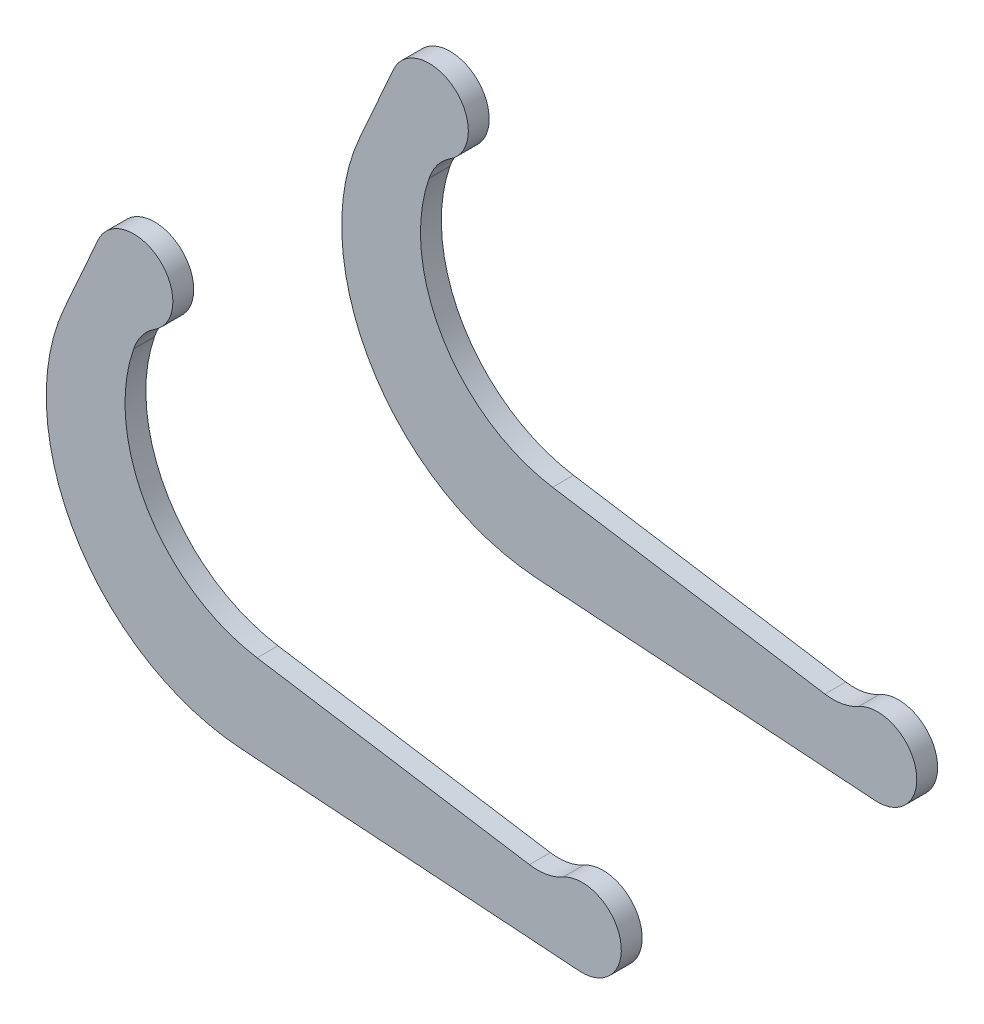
ISO-10303-21;
HEADER;
FILE_DESCRIPTION(('STEP AP214'),'2;1');
FILE_NAME('part.step','',(''),(''),'','','');
FILE_SCHEMA(('AUTOMOTIVE_DESIGN { 1 0 10303 214 1 1 1 1 }'));
ENDSEC;
DATA;
#1=APPLICATION_CONTEXT('core data for automotive mechanical design processes');
#2=APPLICATION_PROTOCOL_DEFINITION('international standard','automotive_design',2000,#1);
#3=PRODUCT_CONTEXT('',#1,'mechanical');
#4=PRODUCT('Part','Part','',(#3));
#5=PRODUCT_RELATED_PRODUCT_CATEGORY('part','',(#4));
#6=PRODUCT_DEFINITION_FORMATION('','',#4);
#7=PRODUCT_DEFINITION_CONTEXT('part definition',#1,'design');
#8=PRODUCT_DEFINITION('design','',#6,#7);
#9=PRODUCT_DEFINITION_SHAPE('','',#8);
#10=(LENGTH_UNIT() NAMED_UNIT(*) SI_UNIT(.MILLI.,.METRE.));
#11=(NAMED_UNIT(*) PLANE_ANGLE_UNIT() SI_UNIT($,.RADIAN.));
#12=(NAMED_UNIT(*) SI_UNIT($,.STERADIAN.) SOLID_ANGLE_UNIT());
#13=UNCERTAINTY_MEASURE_WITH_UNIT(LENGTH_MEASURE(1.E-05),#10,'distance_accuracy_value','');
#14=(GEOMETRIC_REPRESENTATION_CONTEXT(3) GLOBAL_UNCERTAINTY_ASSIGNED_CONTEXT((#13)) GLOBAL_UNIT_ASSIGNED_CONTEXT((#10,
#11,#12)) REPRESENTATION_CONTEXT('',''));
#15=CARTESIAN_POINT('',(0.,0.,0.));
#16=DIRECTION('',(0.,0.,1.));
#17=DIRECTION('',(1.,0.,0.));
#18=AXIS2_PLACEMENT_3D('',#15,#16,#17);
#19=CARTESIAN_POINT('',(58.5239082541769,438.182860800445,-60.6500000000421));
#20=DIRECTION('',(-0.913861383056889,0.406026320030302,0.));
#21=DIRECTION('',(-0.406026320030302,-0.913861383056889,0.));
#22=AXIS2_PLACEMENT_3D('',#19,#20,#21);
#23=PLANE('',#22);
#24=DIRECTION('',(-0.406026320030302,-0.913861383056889,8.37068520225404E-13));
#25=VECTOR('',#24,1.);
#26=CARTESIAN_POINT('',(58.5239082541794,438.182860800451,-52.6500000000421));
#27=LINE('',#26,#25);
#28=CARTESIAN_POINT('',(58.5239082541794,438.182860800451,-52.6500000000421));
#29=VERTEX_POINT('',#28);
#30=CARTESIAN_POINT('',(45.5760695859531,409.040588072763,-52.6500000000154));
#31=VERTEX_POINT('',#30);
#32=EDGE_CURVE('P0_E146',#29,#31,#27,.T.);
#33=ORIENTED_EDGE('',*,*,#32,.F.);
#34=DIRECTION('',(3.1245699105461E-13,7.77144949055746E-13,1.));
#35=VECTOR('',#34,1.);
#36=CARTESIAN_POINT('',(58.5239082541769,438.182860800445,-60.6500000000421));
#37=LINE('',#36,#35);
#38=CARTESIAN_POINT('',(58.5239082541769,438.182860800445,-60.6500000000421));
#39=VERTEX_POINT('',#38);
#40=EDGE_CURVE('P0_E67',#39,#29,#37,.T.);
#41=ORIENTED_EDGE('',*,*,#40,.F.);
#42=DIRECTION('',(-0.406026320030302,-0.913861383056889,8.37068520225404E-13));
#43=VECTOR('',#42,1.);
#44=CARTESIAN_POINT('',(58.5239082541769,438.182860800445,-60.6500000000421));
#45=LINE('',#44,#43);
#46=CARTESIAN_POINT('',(45.5760695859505,409.040588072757,-60.6500000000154));
#47=VERTEX_POINT('',#46);
#48=EDGE_CURVE('P0_E118',#39,#47,#45,.T.);
#49=ORIENTED_EDGE('',*,*,#48,.T.);
#50=DIRECTION('',(3.1245699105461E-13,7.77144949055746E-13,1.));
#51=VECTOR('',#50,1.);
#52=CARTESIAN_POINT('',(45.5760695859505,409.040588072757,-60.6500000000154));
#53=LINE('',#52,#51);
#54=EDGE_CURVE('P0_E11',#47,#31,#53,.T.);
#55=ORIENTED_EDGE('',*,*,#54,.T.);
#56=EDGE_LOOP('',(#33,#41,#49,#55));
#57=FACE_BOUND('',#56,.T.);
#58=ADVANCED_FACE('P0_F16',(#57),#23,.T.);
#59=CARTESIAN_POINT('',(118.684980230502,376.558482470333,-60.650000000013));
#60=DIRECTION('',(3.1245699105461E-13,7.77144949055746E-13,1.));
#61=DIRECTION('',(0.,-1.,7.77144949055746E-13));
#62=AXIS2_PLACEMENT_3D('',#59,#60,#61);
#63=CYLINDRICAL_SURFACE('',#62,80.);
#64=CARTESIAN_POINT('',(118.684980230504,376.558482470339,-52.650000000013));
#65=DIRECTION('',(3.1245699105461E-13,7.77144949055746E-13,1.));
#66=DIRECTION('',(0.,1.,-7.77144949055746E-13));
#67=AXIS2_PLACEMENT_3D('',#64,#65,#66);
#68=CIRCLE('',#67,80.);
#69=CARTESIAN_POINT('',(113.166505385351,296.749044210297,-52.6499999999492));
#70=VERTEX_POINT('',#69);
#71=EDGE_CURVE('P0_E149',#31,#70,#68,.T.);
#72=ORIENTED_EDGE('',*,*,#71,.F.);
#73=ORIENTED_EDGE('',*,*,#54,.F.);
#74=CARTESIAN_POINT('',(118.684980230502,376.558482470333,-60.650000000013));
#75=DIRECTION('',(3.1245699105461E-13,7.77144949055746E-13,1.));
#76=DIRECTION('',(0.,1.,-7.77144949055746E-13));
#77=AXIS2_PLACEMENT_3D('',#74,#75,#76);
#78=CIRCLE('',#77,80.);
#79=CARTESIAN_POINT('',(113.166505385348,296.749044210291,-60.6499999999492));
#80=VERTEX_POINT('',#79);
#81=EDGE_CURVE('P0_E120',#47,#80,#78,.T.);
#82=ORIENTED_EDGE('',*,*,#81,.T.);
#83=DIRECTION('',(3.1245699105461E-13,7.77144949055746E-13,1.));
#84=VECTOR('',#83,1.);
#85=CARTESIAN_POINT('',(113.166505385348,296.749044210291,-60.6499999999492));
#86=LINE('',#85,#84);
#87=EDGE_CURVE('P0_E20',#80,#70,#86,.T.);
#88=ORIENTED_EDGE('',*,*,#87,.T.);
#89=EDGE_LOOP('',(#72,#73,#82,#88));
#90=FACE_BOUND('',#89,.T.);
#91=ADVANCED_FACE('P0_F164',(#90),#63,.T.);
#92=CARTESIAN_POINT('',(63.1127342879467,300.210044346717,-60.6499999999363));
#93=DIRECTION('',(-0.0689809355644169,-0.997617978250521,7.96847348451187E-13));
#94=DIRECTION('',(0.997617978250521,-0.0689809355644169,0.));
#95=AXIS2_PLACEMENT_3D('',#92,#93,#94);
#96=PLANE('',#95);
#97=DIRECTION('',(0.997617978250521,-0.0689809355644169,-2.58104526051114E-13));
#98=VECTOR('',#97,1.);
#99=CARTESIAN_POINT('',(63.1127342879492,300.210044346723,-52.6499999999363));
#100=LINE('',#99,#98);
#101=CARTESIAN_POINT('',(243.150900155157,287.761189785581,-52.6499999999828));
#102=VERTEX_POINT('',#101);
#103=EDGE_CURVE('P0_E125',#70,#102,#100,.T.);
#104=ORIENTED_EDGE('',*,*,#103,.F.);
#105=ORIENTED_EDGE('',*,*,#87,.F.);
#106=DIRECTION('',(0.997617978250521,-0.0689809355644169,-2.58104526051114E-13));
#107=VECTOR('',#106,1.);
#108=CARTESIAN_POINT('',(63.1127342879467,300.210044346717,-60.6499999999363));
#109=LINE('',#108,#107);
#110=CARTESIAN_POINT('',(243.150900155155,287.761189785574,-60.6499999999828));
#111=VERTEX_POINT('',#110);
#112=EDGE_CURVE('P0_E151',#80,#111,#109,.T.);
#113=ORIENTED_EDGE('',*,*,#112,.T.);
#114=DIRECTION('',(3.1245699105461E-13,7.77144949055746E-13,1.));
#115=VECTOR('',#114,1.);
#116=CARTESIAN_POINT('',(243.150900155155,287.761189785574,-60.6499999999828));
#117=LINE('',#116,#115);
#118=EDGE_CURVE('P0_E162',#111,#102,#117,.T.);
#119=ORIENTED_EDGE('',*,*,#118,.T.);
#120=EDGE_LOOP('',(#104,#105,#113,#119));
#121=FACE_BOUND('',#120,.T.);
#122=ADVANCED_FACE('P0_F18',(#121),#96,.T.);
#123=CARTESIAN_POINT('',(244.185614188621,302.725459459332,-60.6499999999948));
#124=DIRECTION('',(3.1245699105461E-13,7.77144949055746E-13,1.));
#125=DIRECTION('',(0.,-1.,7.77144949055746E-13));
#126=AXIS2_PLACEMENT_3D('',#123,#124,#125);
#127=CYLINDRICAL_SURFACE('',#126,15.);
#128=CARTESIAN_POINT('',(244.185614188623,302.725459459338,-52.6499999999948));
#129=DIRECTION('',(3.1245699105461E-13,7.77144949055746E-13,1.));
#130=DIRECTION('',(0.,1.,-7.77144949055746E-13));
#131=AXIS2_PLACEMENT_3D('',#128,#129,#130);
#132=CIRCLE('',#131,15.);
#133=CARTESIAN_POINT('',(236.854524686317,315.811907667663,-52.6500000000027));
#134=VERTEX_POINT('',#133);
#135=EDGE_CURVE('P0_E128',#102,#134,#132,.T.);
#136=ORIENTED_EDGE('',*,*,#135,.F.);
#137=ORIENTED_EDGE('',*,*,#118,.F.);
#138=CARTESIAN_POINT('',(244.185614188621,302.725459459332,-60.6499999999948));
#139=DIRECTION('',(3.1245699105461E-13,7.77144949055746E-13,1.));
#140=DIRECTION('',(0.,1.,-7.77144949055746E-13));
#141=AXIS2_PLACEMENT_3D('',#138,#139,#140);
#142=CIRCLE('',#141,15.);
#143=CARTESIAN_POINT('',(236.854524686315,315.811907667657,-60.6500000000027));
#144=VERTEX_POINT('',#143);
#145=EDGE_CURVE('P0_E220',#111,#144,#142,.T.);
#146=ORIENTED_EDGE('',*,*,#145,.T.);
#147=DIRECTION('',(3.1245699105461E-13,7.77144949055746E-13,1.));
#148=VECTOR('',#147,1.);
#149=CARTESIAN_POINT('',(236.854524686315,315.811907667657,-60.6500000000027));
#150=LINE('',#149,#148);
#151=EDGE_CURVE('P0_E161',#144,#134,#150,.T.);
#152=ORIENTED_EDGE('',*,*,#151,.T.);
#153=EDGE_LOOP('',(#136,#137,#146,#152));
#154=FACE_BOUND('',#153,.T.);
#155=ADVANCED_FACE('P0_F195',(#154),#127,.T.);
#156=CARTESIAN_POINT('',(227.07973868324,333.260505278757,-60.6500000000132));
#157=DIRECTION('',(3.1245699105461E-13,7.77144949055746E-13,1.));
#158=DIRECTION('',(0.,-1.,7.77144949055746E-13));
#159=AXIS2_PLACEMENT_3D('',#156,#157,#158);
#160=CYLINDRICAL_SURFACE('',#159,20.);
#161=CARTESIAN_POINT('',(227.079738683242,333.260505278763,-52.6500000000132));
#162=DIRECTION('',(-3.1245699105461E-13,-7.77144949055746E-13,-1.));
#163=DIRECTION('',(0.,1.,-7.77144949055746E-13));
#164=AXIS2_PLACEMENT_3D('',#161,#162,#163);
#165=CIRCLE('',#164,20.);
#166=CARTESIAN_POINT('',(223.966407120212,313.504312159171,-52.6499999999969));
#167=VERTEX_POINT('',#166);
#168=EDGE_CURVE('P0_E131',#134,#167,#165,.T.);
#169=ORIENTED_EDGE('',*,*,#168,.F.);
#170=ORIENTED_EDGE('',*,*,#151,.F.);
#171=CARTESIAN_POINT('',(227.07973868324,333.260505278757,-60.6500000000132));
#172=DIRECTION('',(-3.1245699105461E-13,-7.77144949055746E-13,-1.));
#173=DIRECTION('',(0.,1.,-7.77144949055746E-13));
#174=AXIS2_PLACEMENT_3D('',#171,#172,#173);
#175=CIRCLE('',#174,20.);
#176=CARTESIAN_POINT('',(223.966407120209,313.504312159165,-60.6499999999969));
#177=VERTEX_POINT('',#176);
#178=EDGE_CURVE('P0_E207',#144,#177,#175,.T.);
#179=ORIENTED_EDGE('',*,*,#178,.T.);
#180=DIRECTION('',(3.1245699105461E-13,7.77144949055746E-13,1.));
#181=VECTOR('',#180,1.);
#182=CARTESIAN_POINT('',(223.966407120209,313.504312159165,-60.6499999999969));
#183=LINE('',#182,#181);
#184=EDGE_CURVE('P0_E159',#177,#167,#183,.T.);
#185=ORIENTED_EDGE('',*,*,#184,.T.);
#186=EDGE_LOOP('',(#169,#170,#179,#185));
#187=FACE_BOUND('',#186,.T.);
#188=ADVANCED_FACE('P0_F192',(#187),#160,.F.);
#189=CARTESIAN_POINT('',(232.521089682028,312.156200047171,-60.6499999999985));
#190=DIRECTION('',(0.155666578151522,0.987809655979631,-8.16310395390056E-13));
#191=DIRECTION('',(-0.987809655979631,0.155666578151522,0.));
#192=AXIS2_PLACEMENT_3D('',#189,#190,#191);
#193=PLANE('',#192);
#194=DIRECTION('',(-0.987809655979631,0.155666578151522,1.87672537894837E-13));
#195=VECTOR('',#194,1.);
#196=CARTESIAN_POINT('',(232.521089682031,312.156200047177,-52.6499999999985));
#197=LINE('',#196,#195);
#198=CARTESIAN_POINT('',(119.540383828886,329.960561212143,-52.649999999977));
#199=VERTEX_POINT('',#198);
#200=EDGE_CURVE('P0_E134',#167,#199,#197,.T.);
#201=ORIENTED_EDGE('',*,*,#200,.F.);
#202=ORIENTED_EDGE('',*,*,#184,.F.);
#203=DIRECTION('',(-0.987809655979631,0.155666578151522,1.87672537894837E-13));
#204=VECTOR('',#203,1.);
#205=CARTESIAN_POINT('',(232.521089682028,312.156200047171,-60.6499999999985));
#206=LINE('',#205,#204);
#207=CARTESIAN_POINT('',(119.540383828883,329.960561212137,-60.649999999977));
#208=VERTEX_POINT('',#207);
#209=EDGE_CURVE('P0_E211',#177,#208,#206,.T.);
#210=ORIENTED_EDGE('',*,*,#209,.T.);
#211=DIRECTION('',(3.1245699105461E-13,7.77144949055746E-13,1.));
#212=VECTOR('',#211,1.);
#213=CARTESIAN_POINT('',(119.540383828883,329.960561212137,-60.649999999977));
#214=LINE('',#213,#212);
#215=EDGE_CURVE('P0_E157',#208,#199,#214,.T.);
#216=ORIENTED_EDGE('',*,*,#215,.T.);
#217=EDGE_LOOP('',(#201,#202,#210,#216));
#218=FACE_BOUND('',#217,.T.);
#219=ADVANCED_FACE('P0_F188',(#218),#193,.T.);
#220=CARTESIAN_POINT('',(128.880378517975,389.229140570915,-60.650000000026));
#221=DIRECTION('',(3.1245699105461E-13,7.77144949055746E-13,1.));
#222=DIRECTION('',(0.,-1.,7.77144949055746E-13));
#223=AXIS2_PLACEMENT_3D('',#220,#221,#222);
#224=CYLINDRICAL_SURFACE('',#223,60.);
#225=CARTESIAN_POINT('',(128.880378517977,389.229140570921,-52.650000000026));
#226=DIRECTION('',(-3.1245699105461E-13,-7.77144949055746E-13,-1.));
#227=DIRECTION('',(0.,1.,-7.77144949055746E-13));
#228=AXIS2_PLACEMENT_3D('',#225,#226,#227);
#229=CIRCLE('',#228,60.);
#230=CARTESIAN_POINT('',(72.1340951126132,408.719120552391,-52.6500000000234));
#231=VERTEX_POINT('',#230);
#232=EDGE_CURVE('P0_E137',#199,#231,#229,.T.);
#233=ORIENTED_EDGE('',*,*,#232,.F.);
#234=ORIENTED_EDGE('',*,*,#215,.F.);
#235=CARTESIAN_POINT('',(128.880378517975,389.229140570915,-60.650000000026));
#236=DIRECTION('',(-3.1245699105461E-13,-7.77144949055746E-13,-1.));
#237=DIRECTION('',(0.,1.,-7.77144949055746E-13));
#238=AXIS2_PLACEMENT_3D('',#235,#236,#237);
#239=CIRCLE('',#238,60.);
#240=CARTESIAN_POINT('',(72.1340951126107,408.719120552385,-60.6500000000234));
#241=VERTEX_POINT('',#240);
#242=EDGE_CURVE('P0_E215',#208,#241,#239,.T.);
#243=ORIENTED_EDGE('',*,*,#242,.T.);
#244=DIRECTION('',(3.1245699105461E-13,7.77144949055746E-13,1.));
#245=VECTOR('',#244,1.);
#246=CARTESIAN_POINT('',(72.1340951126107,408.719120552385,-60.6500000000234));
#247=LINE('',#246,#245);
#248=EDGE_CURVE('P0_E155',#241,#231,#247,.T.);
#249=ORIENTED_EDGE('',*,*,#248,.T.);
#250=EDGE_LOOP('',(#233,#234,#243,#249));
#251=FACE_BOUND('',#250,.T.);
#252=ADVANCED_FACE('P0_F184',(#251),#224,.F.);
#253=CARTESIAN_POINT('',(72.1340951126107,408.719120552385,-60.6500000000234));
#254=DIRECTION('',(0.945771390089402,-0.324832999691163,0.));
#255=DIRECTION('',(0.324832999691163,0.945771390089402,0.));
#256=AXIS2_PLACEMENT_3D('',#253,#254,#255);
#257=PLANE('',#256);
#258=DIRECTION('',(0.324832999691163,0.945771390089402,-8.36497800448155E-13));
#259=VECTOR('',#258,1.);
#260=CARTESIAN_POINT('',(72.1340951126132,408.719120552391,-52.6500000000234));
#261=LINE('',#260,#259);
#262=CARTESIAN_POINT('',(72.292273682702,409.179667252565,-52.6500000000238));
#263=VERTEX_POINT('',#262);
#264=EDGE_CURVE('P0_E140',#231,#263,#261,.T.);
#265=ORIENTED_EDGE('',*,*,#264,.F.);
#266=ORIENTED_EDGE('',*,*,#248,.F.);
#267=DIRECTION('',(0.324832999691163,0.945771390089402,-8.36497800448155E-13));
#268=VECTOR('',#267,1.);
#269=CARTESIAN_POINT('',(72.1340951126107,408.719120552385,-60.6500000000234));
#270=LINE('',#269,#268);
#271=CARTESIAN_POINT('',(72.2922736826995,409.179667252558,-60.6500000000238));
#272=VERTEX_POINT('',#271);
#273=EDGE_CURVE('P0_E115',#241,#272,#270,.T.);
#274=ORIENTED_EDGE('',*,*,#273,.T.);
#275=DIRECTION('',(3.1245699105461E-13,7.77144949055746E-13,1.));
#276=VECTOR('',#275,1.);
#277=CARTESIAN_POINT('',(72.2922736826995,409.179667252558,-60.6500000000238));
#278=LINE('',#277,#276);
#279=EDGE_CURVE('P0_E107',#272,#263,#278,.T.);
#280=ORIENTED_EDGE('',*,*,#279,.T.);
#281=EDGE_LOOP('',(#265,#266,#274,#280));
#282=FACE_BOUND('',#281,.T.);
#283=ADVANCED_FACE('P0_F181',(#282),#257,.T.);
#284=CARTESIAN_POINT('',(91.2077014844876,402.683007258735,-60.6500000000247));
#285=DIRECTION('',(3.1245699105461E-13,7.77144949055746E-13,1.));
#286=DIRECTION('',(0.,-1.,7.77144949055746E-13));
#287=AXIS2_PLACEMENT_3D('',#284,#285,#286);
#288=CYLINDRICAL_SURFACE('',#287,20.);
#289=CARTESIAN_POINT('',(91.2077014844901,402.683007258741,-52.6500000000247));
#290=DIRECTION('',(-3.1245699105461E-13,-7.77144949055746E-13,-1.));
#291=DIRECTION('',(0.,1.,-7.77144949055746E-13));
#292=AXIS2_PLACEMENT_3D('',#289,#290,#291);
#293=CIRCLE('',#292,20.);
#294=CARTESIAN_POINT('',(80.3643457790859,419.488412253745,-52.6500000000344));
#295=VERTEX_POINT('',#294);
#296=EDGE_CURVE('P0_E143',#263,#295,#293,.T.);
#297=ORIENTED_EDGE('',*,*,#296,.F.);
#298=ORIENTED_EDGE('',*,*,#279,.F.);
#299=CARTESIAN_POINT('',(91.2077014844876,402.683007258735,-60.6500000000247));
#300=DIRECTION('',(-3.1245699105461E-13,-7.77144949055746E-13,-1.));
#301=DIRECTION('',(0.,1.,-7.77144949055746E-13));
#302=AXIS2_PLACEMENT_3D('',#299,#300,#301);
#303=CIRCLE('',#302,20.);
#304=CARTESIAN_POINT('',(80.3643457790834,419.488412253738,-60.6500000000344));
#305=VERTEX_POINT('',#304);
#306=EDGE_CURVE('P0_E110',#272,#305,#303,.T.);
#307=ORIENTED_EDGE('',*,*,#306,.T.);
#308=DIRECTION('',(3.1245699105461E-13,7.77144949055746E-13,1.));
#309=VECTOR('',#308,1.);
#310=CARTESIAN_POINT('',(80.3643457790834,419.488412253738,-60.6500000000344));
#311=LINE('',#310,#309);
#312=EDGE_CURVE('P0_E97',#305,#295,#311,.T.);
#313=ORIENTED_EDGE('',*,*,#312,.T.);
#314=EDGE_LOOP('',(#297,#298,#307,#313));
#315=FACE_BOUND('',#314,.T.);
#316=ADVANCED_FACE('P0_F111',(#315),#288,.F.);
#317=CARTESIAN_POINT('',(72.2318290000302,432.092465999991,-60.6500000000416));
#318=DIRECTION('',(3.1245699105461E-13,7.77144949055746E-13,1.));
#319=DIRECTION('',(0.,-1.,7.77144949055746E-13));
#320=AXIS2_PLACEMENT_3D('',#317,#318,#319);
#321=CYLINDRICAL_SURFACE('',#320,15.);
#322=CARTESIAN_POINT('',(72.2318290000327,432.092465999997,-52.6500000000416));
#323=DIRECTION('',(3.1245699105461E-13,7.77144949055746E-13,1.));
#324=DIRECTION('',(0.,1.,-7.77144949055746E-13));
#325=AXIS2_PLACEMENT_3D('',#322,#323,#324);
#326=CIRCLE('',#325,15.);
#327=EDGE_CURVE('P0_E103',#295,#29,#326,.T.);
#328=ORIENTED_EDGE('',*,*,#327,.F.);
#329=ORIENTED_EDGE('',*,*,#312,.F.);
#330=CARTESIAN_POINT('',(72.2318290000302,432.092465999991,-60.6500000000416));
#331=DIRECTION('',(3.1245699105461E-13,7.77144949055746E-13,1.));
#332=DIRECTION('',(0.,1.,-7.77144949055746E-13));
#333=AXIS2_PLACEMENT_3D('',#330,#331,#332);
#334=CIRCLE('',#333,15.);
#335=EDGE_CURVE('P0_E101',#305,#39,#334,.T.);
#336=ORIENTED_EDGE('',*,*,#335,.T.);
#337=ORIENTED_EDGE('',*,*,#40,.T.);
#338=EDGE_LOOP('',(#328,#329,#336,#337));
#339=FACE_BOUND('',#338,.T.);
#340=ADVANCED_FACE('P0_F99',(#339),#321,.T.);
#341=CARTESIAN_POINT('',(148.935297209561,367.408962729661,-60.6500000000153));
#342=DIRECTION('',(3.12461839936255E-13,7.77148453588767E-13,1.));
#343=DIRECTION('',(0.,-1.,7.77148453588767E-13));
#344=AXIS2_PLACEMENT_3D('',#341,#342,#343);
#345=PLANE('',#344);
#346=ORIENTED_EDGE('',*,*,#48,.F.);
#347=ORIENTED_EDGE('',*,*,#335,.F.);
#348=ORIENTED_EDGE('',*,*,#306,.F.);
#349=ORIENTED_EDGE('',*,*,#273,.F.);
#350=ORIENTED_EDGE('',*,*,#242,.F.);
#351=ORIENTED_EDGE('',*,*,#209,.F.);
#352=ORIENTED_EDGE('',*,*,#178,.F.);
#353=ORIENTED_EDGE('',*,*,#145,.F.);
#354=ORIENTED_EDGE('',*,*,#112,.F.);
#355=ORIENTED_EDGE('',*,*,#81,.F.);
#356=EDGE_LOOP('',(#346,#347,#348,#349,#350,#351,#352,#353,#354,#355));
#357=FACE_BOUND('',#356,.T.);
#358=ADVANCED_FACE('P0_F117',(#357),#345,.F.);
#359=CARTESIAN_POINT('',(148.935297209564,367.408962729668,-52.6500000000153));
#360=DIRECTION('',(3.12461839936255E-13,7.77148453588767E-13,1.));
#361=DIRECTION('',(0.,-1.,7.77148453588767E-13));
#362=AXIS2_PLACEMENT_3D('',#359,#360,#361);
#363=PLANE('',#362);
#364=ORIENTED_EDGE('',*,*,#32,.T.);
#365=ORIENTED_EDGE('',*,*,#71,.T.);
#366=ORIENTED_EDGE('',*,*,#103,.T.);
#367=ORIENTED_EDGE('',*,*,#135,.T.);
#368=ORIENTED_EDGE('',*,*,#168,.T.);
#369=ORIENTED_EDGE('',*,*,#200,.T.);
#370=ORIENTED_EDGE('',*,*,#232,.T.);
#371=ORIENTED_EDGE('',*,*,#264,.T.);
#372=ORIENTED_EDGE('',*,*,#296,.T.);
#373=ORIENTED_EDGE('',*,*,#327,.T.);
#374=EDGE_LOOP('',(#364,#365,#366,#367,#368,#369,#370,#371,#372,#373));
#375=FACE_BOUND('',#374,.T.);
#376=ADVANCED_FACE('P0_F167',(#375),#363,.T.);
#377=CLOSED_SHELL('',(#58,#91,#122,#155,#188,#219,#252,#283,#316,#340,#358,#376));
#378=MANIFOLD_SOLID_BREP('P0_B1',#377);
#379=CARTESIAN_POINT('',(58.5239082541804,438.182860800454,52.6500000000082));
#380=DIRECTION('',(-0.91386138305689,0.406026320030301,0.));
#381=DIRECTION('',(-0.406026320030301,-0.91386138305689,0.));
#382=AXIS2_PLACEMENT_3D('',#379,#380,#381);
#383=PLANE('',#382);
#384=DIRECTION('',(-0.406026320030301,-0.91386138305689,-3.6780528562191E-13));
#385=VECTOR('',#384,1.);
#386=CARTESIAN_POINT('',(58.5239082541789,438.182860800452,60.6500000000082));
#387=LINE('',#386,#385);
#388=CARTESIAN_POINT('',(58.5239082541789,438.182860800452,60.6500000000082));
#389=VERTEX_POINT('',#388);
#390=CARTESIAN_POINT('',(45.5760695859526,409.040588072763,60.6499999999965));
#391=VERTEX_POINT('',#390);
#392=EDGE_CURVE('P1_E145',#389,#391,#387,.T.);
#393=ORIENTED_EDGE('',*,*,#392,.F.);
#394=DIRECTION('',(-1.83029422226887E-13,-3.21154311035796E-13,1.));
#395=VECTOR('',#394,1.);
#396=CARTESIAN_POINT('',(58.5239082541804,438.182860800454,52.6500000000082));
#397=LINE('',#396,#395);
#398=CARTESIAN_POINT('',(58.5239082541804,438.182860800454,52.6500000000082));
#399=VERTEX_POINT('',#398);
#400=EDGE_CURVE('P1_E66',#399,#389,#397,.T.);
#401=ORIENTED_EDGE('',*,*,#400,.F.);
#402=DIRECTION('',(-0.406026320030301,-0.91386138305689,-3.6780528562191E-13));
#403=VECTOR('',#402,1.);
#404=CARTESIAN_POINT('',(58.5239082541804,438.182860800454,52.6500000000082));
#405=LINE('',#404,#403);
#406=CARTESIAN_POINT('',(45.576069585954,409.040588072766,52.6499999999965));
#407=VERTEX_POINT('',#406);
#408=EDGE_CURVE('P1_E117',#399,#407,#405,.T.);
#409=ORIENTED_EDGE('',*,*,#408,.T.);
#410=DIRECTION('',(-1.83029422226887E-13,-3.21154311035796E-13,1.));
#411=VECTOR('',#410,1.);
#412=CARTESIAN_POINT('',(45.576069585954,409.040588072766,52.6499999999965));
#413=LINE('',#412,#411);
#414=EDGE_CURVE('P1_E10',#407,#391,#413,.T.);
#415=ORIENTED_EDGE('',*,*,#414,.T.);
#416=EDGE_LOOP('',(#393,#401,#409,#415));
#417=FACE_BOUND('',#416,.T.);
#418=ADVANCED_FACE('P1_F15',(#417),#383,.T.);
#419=CARTESIAN_POINT('',(118.684980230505,376.558482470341,52.6499999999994));
#420=DIRECTION('',(-1.83029422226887E-13,-3.21154311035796E-13,1.));
#421=DIRECTION('',(0.,-1.,-3.21154311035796E-13));
#422=AXIS2_PLACEMENT_3D('',#419,#420,#421);
#423=CYLINDRICAL_SURFACE('',#422,80.);
#424=CARTESIAN_POINT('',(118.684980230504,376.558482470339,60.6499999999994));
#425=DIRECTION('',(-1.83029422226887E-13,-3.21154311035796E-13,1.));
#426=DIRECTION('',(0.,1.,3.21154311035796E-13));
#427=AXIS2_PLACEMENT_3D('',#424,#425,#426);
#428=CIRCLE('',#427,80.);
#429=CARTESIAN_POINT('',(113.16650538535,296.749044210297,60.6499999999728));
#430=VERTEX_POINT('',#429);
#431=EDGE_CURVE('P1_E148',#391,#430,#428,.T.);
#432=ORIENTED_EDGE('',*,*,#431,.F.);
#433=ORIENTED_EDGE('',*,*,#414,.F.);
#434=CARTESIAN_POINT('',(118.684980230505,376.558482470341,52.6499999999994));
#435=DIRECTION('',(-1.83029422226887E-13,-3.21154311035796E-13,1.));
#436=DIRECTION('',(0.,1.,3.21154311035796E-13));
#437=AXIS2_PLACEMENT_3D('',#434,#435,#436);
#438=CIRCLE('',#437,80.);
#439=CARTESIAN_POINT('',(113.166505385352,296.7490442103,52.6499999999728));
#440=VERTEX_POINT('',#439);
#441=EDGE_CURVE('P1_E119',#407,#440,#438,.T.);
#442=ORIENTED_EDGE('',*,*,#441,.T.);
#443=DIRECTION('',(-1.83029422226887E-13,-3.21154311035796E-13,1.));
#444=VECTOR('',#443,1.);
#445=CARTESIAN_POINT('',(113.166505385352,296.7490442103,52.6499999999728));
#446=LINE('',#445,#444);
#447=EDGE_CURVE('P1_E19',#440,#430,#446,.T.);
#448=ORIENTED_EDGE('',*,*,#447,.T.);
#449=EDGE_LOOP('',(#432,#433,#442,#448));
#450=FACE_BOUND('',#449,.T.);
#451=ADVANCED_FACE('P1_F163',(#450),#423,.T.);
#452=CARTESIAN_POINT('',(63.1127342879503,300.210044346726,52.6499999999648));
#453=DIRECTION('',(-0.0689809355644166,-0.997617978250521,-3.33014855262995E-13));
#454=DIRECTION('',(0.997617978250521,-0.0689809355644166,0.));
#455=AXIS2_PLACEMENT_3D('',#452,#453,#454);
#456=PLANE('',#455);
#457=DIRECTION('',(0.997617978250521,-0.0689809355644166,1.60439917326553E-13));
#458=VECTOR('',#457,1.);
#459=CARTESIAN_POINT('',(63.1127342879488,300.210044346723,60.6499999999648));
#460=LINE('',#459,#458);
#461=CARTESIAN_POINT('',(243.150900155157,287.761189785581,60.6499999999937));
#462=VERTEX_POINT('',#461);
#463=EDGE_CURVE('P1_E124',#430,#462,#460,.T.);
#464=ORIENTED_EDGE('',*,*,#463,.F.);
#465=ORIENTED_EDGE('',*,*,#447,.F.);
#466=DIRECTION('',(0.997617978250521,-0.0689809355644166,1.60439917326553E-13));
#467=VECTOR('',#466,1.);
#468=CARTESIAN_POINT('',(63.1127342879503,300.210044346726,52.6499999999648));
#469=LINE('',#468,#467);
#470=CARTESIAN_POINT('',(243.150900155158,287.761189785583,52.6499999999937));
#471=VERTEX_POINT('',#470);
#472=EDGE_CURVE('P1_E150',#440,#471,#469,.T.);
#473=ORIENTED_EDGE('',*,*,#472,.T.);
#474=DIRECTION('',(-1.83029422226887E-13,-3.21154311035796E-13,1.));
#475=VECTOR('',#474,1.);
#476=CARTESIAN_POINT('',(243.150900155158,287.761189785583,52.6499999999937));
#477=LINE('',#476,#475);
#478=EDGE_CURVE('P1_E161',#471,#462,#477,.T.);
#479=ORIENTED_EDGE('',*,*,#478,.T.);
#480=EDGE_LOOP('',(#464,#465,#473,#479));
#481=FACE_BOUND('',#480,.T.);
#482=ADVANCED_FACE('P1_F17',(#481),#456,.T.);
#483=CARTESIAN_POINT('',(244.185614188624,302.725459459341,52.6499999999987));
#484=DIRECTION('',(-1.83029422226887E-13,-3.21154311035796E-13,1.));
#485=DIRECTION('',(0.,-1.,-3.21154311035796E-13));
#486=AXIS2_PLACEMENT_3D('',#483,#484,#485);
#487=CYLINDRICAL_SURFACE('',#486,15.);
#488=CARTESIAN_POINT('',(244.185614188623,302.725459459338,60.6499999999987));
#489=DIRECTION('',(-1.83029422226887E-13,-3.21154311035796E-13,1.));
#490=DIRECTION('',(0.,1.,3.21154311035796E-13));
#491=AXIS2_PLACEMENT_3D('',#488,#489,#490);
#492=CIRCLE('',#491,15.);
#493=CARTESIAN_POINT('',(236.854524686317,315.811907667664,60.6500000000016));
#494=VERTEX_POINT('',#493);
#495=EDGE_CURVE('P1_E127',#462,#494,#492,.T.);
#496=ORIENTED_EDGE('',*,*,#495,.F.);
#497=ORIENTED_EDGE('',*,*,#478,.F.);
#498=CARTESIAN_POINT('',(244.185614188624,302.725459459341,52.6499999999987));
#499=DIRECTION('',(-1.83029422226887E-13,-3.21154311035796E-13,1.));
#500=DIRECTION('',(0.,1.,3.21154311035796E-13));
#501=AXIS2_PLACEMENT_3D('',#498,#499,#500);
#502=CIRCLE('',#501,15.);
#503=CARTESIAN_POINT('',(236.854524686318,315.811907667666,52.6500000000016));
#504=VERTEX_POINT('',#503);
#505=EDGE_CURVE('P1_E219',#471,#504,#502,.T.);
#506=ORIENTED_EDGE('',*,*,#505,.T.);
#507=DIRECTION('',(-1.83029422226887E-13,-3.21154311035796E-13,1.));
#508=VECTOR('',#507,1.);
#509=CARTESIAN_POINT('',(236.854524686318,315.811907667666,52.6500000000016));
#510=LINE('',#509,#508);
#511=EDGE_CURVE('P1_E160',#504,#494,#510,.T.);
#512=ORIENTED_EDGE('',*,*,#511,.T.);
#513=EDGE_LOOP('',(#496,#497,#506,#512));
#514=FACE_BOUND('',#513,.T.);
#515=ADVANCED_FACE('P1_F194',(#514),#487,.T.);
#516=CARTESIAN_POINT('',(227.079738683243,333.260505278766,52.6500000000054));
#517=DIRECTION('',(-1.83029422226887E-13,-3.21154311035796E-13,1.));
#518=DIRECTION('',(0.,-1.,-3.21154311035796E-13));
#519=AXIS2_PLACEMENT_3D('',#516,#517,#518);
#520=CYLINDRICAL_SURFACE('',#519,20.);
#521=CARTESIAN_POINT('',(227.079738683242,333.260505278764,60.6500000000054));
#522=DIRECTION('',(1.83029422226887E-13,3.21154311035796E-13,-1.));
#523=DIRECTION('',(0.,1.,3.21154311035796E-13));
#524=AXIS2_PLACEMENT_3D('',#521,#522,#523);
#525=CIRCLE('',#524,20.);
#526=CARTESIAN_POINT('',(223.966407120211,313.504312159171,60.6499999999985));
#527=VERTEX_POINT('',#526);
#528=EDGE_CURVE('P1_E130',#494,#527,#525,.T.);
#529=ORIENTED_EDGE('',*,*,#528,.F.);
#530=ORIENTED_EDGE('',*,*,#511,.F.);
#531=CARTESIAN_POINT('',(227.079738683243,333.260505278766,52.6500000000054));
#532=DIRECTION('',(1.83029422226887E-13,3.21154311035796E-13,-1.));
#533=DIRECTION('',(0.,1.,3.21154311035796E-13));
#534=AXIS2_PLACEMENT_3D('',#531,#532,#533);
#535=CIRCLE('',#534,20.);
#536=CARTESIAN_POINT('',(223.966407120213,313.504312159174,52.6499999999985));
#537=VERTEX_POINT('',#536);
#538=EDGE_CURVE('P1_E206',#504,#537,#535,.T.);
#539=ORIENTED_EDGE('',*,*,#538,.T.);
#540=DIRECTION('',(-1.83029422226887E-13,-3.21154311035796E-13,1.));
#541=VECTOR('',#540,1.);
#542=CARTESIAN_POINT('',(223.966407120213,313.504312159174,52.6499999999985));
#543=LINE('',#542,#541);
#544=EDGE_CURVE('P1_E158',#537,#527,#543,.T.);
#545=ORIENTED_EDGE('',*,*,#544,.T.);
#546=EDGE_LOOP('',(#529,#530,#539,#545));
#547=FACE_BOUND('',#546,.T.);
#548=ADVANCED_FACE('P1_F191',(#547),#520,.F.);
#549=CARTESIAN_POINT('',(232.521089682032,312.156200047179,52.6499999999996));
#550=DIRECTION('',(0.155666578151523,0.987809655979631,3.45730893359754E-13));
#551=DIRECTION('',(-0.987809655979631,0.155666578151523,0.));
#552=AXIS2_PLACEMENT_3D('',#549,#550,#551);
#553=PLANE('',#552);
#554=DIRECTION('',(-0.987809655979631,0.155666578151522,-1.3080523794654E-13));
#555=VECTOR('',#554,1.);
#556=CARTESIAN_POINT('',(232.52108968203,312.156200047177,60.6499999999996));
#557=LINE('',#556,#555);
#558=CARTESIAN_POINT('',(119.540383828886,329.960561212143,60.6499999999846));
#559=VERTEX_POINT('',#558);
#560=EDGE_CURVE('P1_E133',#527,#559,#557,.T.);
#561=ORIENTED_EDGE('',*,*,#560,.F.);
#562=ORIENTED_EDGE('',*,*,#544,.F.);
#563=DIRECTION('',(-0.987809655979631,0.155666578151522,-1.3080523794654E-13));
#564=VECTOR('',#563,1.);
#565=CARTESIAN_POINT('',(232.521089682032,312.156200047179,52.6499999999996));
#566=LINE('',#565,#564);
#567=CARTESIAN_POINT('',(119.540383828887,329.960561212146,52.6499999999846));
#568=VERTEX_POINT('',#567);
#569=EDGE_CURVE('P1_E210',#537,#568,#566,.T.);
#570=ORIENTED_EDGE('',*,*,#569,.T.);
#571=DIRECTION('',(-1.83029422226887E-13,-3.21154311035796E-13,1.));
#572=VECTOR('',#571,1.);
#573=CARTESIAN_POINT('',(119.540383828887,329.960561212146,52.6499999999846));
#574=LINE('',#573,#572);
#575=EDGE_CURVE('P1_E156',#568,#559,#574,.T.);
#576=ORIENTED_EDGE('',*,*,#575,.T.);
#577=EDGE_LOOP('',(#561,#562,#570,#576));
#578=FACE_BOUND('',#577,.T.);
#579=ADVANCED_FACE('P1_F187',(#578),#553,.T.);
#580=CARTESIAN_POINT('',(128.880378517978,389.229140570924,52.6500000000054));
#581=DIRECTION('',(-1.83029422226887E-13,-3.21154311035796E-13,1.));
#582=DIRECTION('',(0.,-1.,-3.21154311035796E-13));
#583=AXIS2_PLACEMENT_3D('',#580,#581,#582);
#584=CYLINDRICAL_SURFACE('',#583,60.);
#585=CARTESIAN_POINT('',(128.880378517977,389.229140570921,60.6500000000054));
#586=DIRECTION('',(1.83029422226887E-13,3.21154311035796E-13,-1.));
#587=DIRECTION('',(0.,1.,3.21154311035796E-13));
#588=AXIS2_PLACEMENT_3D('',#585,#586,#587);
#589=CIRCLE('',#588,60.);
#590=CARTESIAN_POINT('',(72.1340951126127,408.719120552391,60.6500000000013));
#591=VERTEX_POINT('',#590);
#592=EDGE_CURVE('P1_E136',#559,#591,#589,.T.);
#593=ORIENTED_EDGE('',*,*,#592,.F.);
#594=ORIENTED_EDGE('',*,*,#575,.F.);
#595=CARTESIAN_POINT('',(128.880378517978,389.229140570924,52.6500000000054));
#596=DIRECTION('',(1.83029422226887E-13,3.21154311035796E-13,-1.));
#597=DIRECTION('',(0.,1.,3.21154311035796E-13));
#598=AXIS2_PLACEMENT_3D('',#595,#596,#597);
#599=CIRCLE('',#598,60.);
#600=CARTESIAN_POINT('',(72.1340951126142,408.719120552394,52.6500000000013));
#601=VERTEX_POINT('',#600);
#602=EDGE_CURVE('P1_E214',#568,#601,#599,.T.);
#603=ORIENTED_EDGE('',*,*,#602,.T.);
#604=DIRECTION('',(-1.83029422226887E-13,-3.21154311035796E-13,1.));
#605=VECTOR('',#604,1.);
#606=CARTESIAN_POINT('',(72.1340951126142,408.719120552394,52.6500000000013));
#607=LINE('',#606,#605);
#608=EDGE_CURVE('P1_E154',#601,#591,#607,.T.);
#609=ORIENTED_EDGE('',*,*,#608,.T.);
#610=EDGE_LOOP('',(#593,#594,#603,#609));
#611=FACE_BOUND('',#610,.T.);
#612=ADVANCED_FACE('P1_F183',(#611),#584,.F.);
#613=CARTESIAN_POINT('',(72.1340951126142,408.719120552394,52.6500000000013));
#614=DIRECTION('',(0.945771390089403,-0.324832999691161,0.));
#615=DIRECTION('',(0.324832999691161,0.945771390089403,0.));
#616=AXIS2_PLACEMENT_3D('',#613,#614,#615);
#617=PLANE('',#616);
#618=DIRECTION('',(0.324832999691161,0.945771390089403,3.63192555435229E-13));
#619=VECTOR('',#618,1.);
#620=CARTESIAN_POINT('',(72.1340951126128,408.719120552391,60.6500000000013));
#621=LINE('',#620,#619);
#622=CARTESIAN_POINT('',(72.2922736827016,409.179667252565,60.6500000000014));
#623=VERTEX_POINT('',#622);
#624=EDGE_CURVE('P1_E139',#591,#623,#621,.T.);
#625=ORIENTED_EDGE('',*,*,#624,.F.);
#626=ORIENTED_EDGE('',*,*,#608,.F.);
#627=DIRECTION('',(0.324832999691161,0.945771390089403,3.63192555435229E-13));
#628=VECTOR('',#627,1.);
#629=CARTESIAN_POINT('',(72.1340951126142,408.719120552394,52.6500000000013));
#630=LINE('',#629,#628);
#631=CARTESIAN_POINT('',(72.292273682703,409.179667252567,52.6500000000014));
#632=VERTEX_POINT('',#631);
#633=EDGE_CURVE('P1_E114',#601,#632,#630,.T.);
#634=ORIENTED_EDGE('',*,*,#633,.T.);
#635=DIRECTION('',(-1.83029422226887E-13,-3.21154311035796E-13,1.));
#636=VECTOR('',#635,1.);
#637=CARTESIAN_POINT('',(72.292273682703,409.179667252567,52.6500000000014));
#638=LINE('',#637,#636);
#639=EDGE_CURVE('P1_E106',#632,#623,#638,.T.);
#640=ORIENTED_EDGE('',*,*,#639,.T.);
#641=EDGE_LOOP('',(#625,#626,#634,#640));
#642=FACE_BOUND('',#641,.T.);
#643=ADVANCED_FACE('P1_F180',(#642),#617,.T.);
#644=CARTESIAN_POINT('',(91.2077014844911,402.683007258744,52.6500000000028));
#645=DIRECTION('',(-1.83029422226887E-13,-3.21154311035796E-13,1.));
#646=DIRECTION('',(0.,-1.,-3.21154311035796E-13));
#647=AXIS2_PLACEMENT_3D('',#644,#645,#646);
#648=CYLINDRICAL_SURFACE('',#647,20.);
#649=CARTESIAN_POINT('',(91.2077014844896,402.683007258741,60.6500000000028));
#650=DIRECTION('',(1.83029422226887E-13,3.21154311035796E-13,-1.));
#651=DIRECTION('',(0.,1.,3.21154311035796E-13));
#652=AXIS2_PLACEMENT_3D('',#649,#650,#651);
#653=CIRCLE('',#652,20.);
#654=CARTESIAN_POINT('',(80.3643457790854,419.488412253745,60.6500000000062));
#655=VERTEX_POINT('',#654);
#656=EDGE_CURVE('P1_E142',#623,#655,#653,.T.);
#657=ORIENTED_EDGE('',*,*,#656,.F.);
#658=ORIENTED_EDGE('',*,*,#639,.F.);
#659=CARTESIAN_POINT('',(91.2077014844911,402.683007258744,52.6500000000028));
#660=DIRECTION('',(1.83029422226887E-13,3.21154311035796E-13,-1.));
#661=DIRECTION('',(0.,1.,3.21154311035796E-13));
#662=AXIS2_PLACEMENT_3D('',#659,#660,#661);
#663=CIRCLE('',#662,20.);
#664=CARTESIAN_POINT('',(80.3643457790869,419.488412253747,52.6500000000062));
#665=VERTEX_POINT('',#664);
#666=EDGE_CURVE('P1_E109',#632,#665,#663,.T.);
#667=ORIENTED_EDGE('',*,*,#666,.T.);
#668=DIRECTION('',(-1.83029422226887E-13,-3.21154311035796E-13,1.));
#669=VECTOR('',#668,1.);
#670=CARTESIAN_POINT('',(80.3643457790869,419.488412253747,52.6500000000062));
#671=LINE('',#670,#669);
#672=EDGE_CURVE('P1_E96',#665,#655,#671,.T.);
#673=ORIENTED_EDGE('',*,*,#672,.T.);
#674=EDGE_LOOP('',(#657,#658,#667,#673));
#675=FACE_BOUND('',#674,.T.);
#676=ADVANCED_FACE('P1_F110',(#675),#648,.F.);
#677=CARTESIAN_POINT('',(72.2318290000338,432.092466,52.6500000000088));
#678=DIRECTION('',(-1.83029422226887E-13,-3.21154311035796E-13,1.));
#679=DIRECTION('',(0.,-1.,-3.21154311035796E-13));
#680=AXIS2_PLACEMENT_3D('',#677,#678,#679);
#681=CYLINDRICAL_SURFACE('',#680,15.);
#682=CARTESIAN_POINT('',(72.2318290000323,432.092465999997,60.6500000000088));
#683=DIRECTION('',(-1.83029422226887E-13,-3.21154311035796E-13,1.));
#684=DIRECTION('',(0.,1.,3.21154311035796E-13));
#685=AXIS2_PLACEMENT_3D('',#682,#683,#684);
#686=CIRCLE('',#685,15.);
#687=EDGE_CURVE('P1_E102',#655,#389,#686,.T.);
#688=ORIENTED_EDGE('',*,*,#687,.F.);
#689=ORIENTED_EDGE('',*,*,#672,.F.);
#690=CARTESIAN_POINT('',(72.2318290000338,432.092466,52.6500000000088));
#691=DIRECTION('',(-1.83029422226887E-13,-3.21154311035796E-13,1.));
#692=DIRECTION('',(0.,1.,3.21154311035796E-13));
#693=AXIS2_PLACEMENT_3D('',#690,#691,#692);
#694=CIRCLE('',#693,15.);
#695=EDGE_CURVE('P1_E100',#665,#399,#694,.T.);
#696=ORIENTED_EDGE('',*,*,#695,.T.);
#697=ORIENTED_EDGE('',*,*,#400,.T.);
#698=EDGE_LOOP('',(#688,#689,#696,#697));
#699=FACE_BOUND('',#698,.T.);
#700=ADVANCED_FACE('P1_F98',(#699),#681,.T.);
#701=CARTESIAN_POINT('',(148.935297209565,367.40896272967,52.6500000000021));
#702=DIRECTION('',(-1.83039640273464E-13,-3.21161696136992E-13,1.));
#703=DIRECTION('',(0.,-1.,-3.21161696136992E-13));
#704=AXIS2_PLACEMENT_3D('',#701,#702,#703);
#705=PLANE('',#704);
#706=ORIENTED_EDGE('',*,*,#408,.F.);
#707=ORIENTED_EDGE('',*,*,#695,.F.);
#708=ORIENTED_EDGE('',*,*,#666,.F.);
#709=ORIENTED_EDGE('',*,*,#633,.F.);
#710=ORIENTED_EDGE('',*,*,#602,.F.);
#711=ORIENTED_EDGE('',*,*,#569,.F.);
#712=ORIENTED_EDGE('',*,*,#538,.F.);
#713=ORIENTED_EDGE('',*,*,#505,.F.);
#714=ORIENTED_EDGE('',*,*,#472,.F.);
#715=ORIENTED_EDGE('',*,*,#441,.F.);
#716=EDGE_LOOP('',(#706,#707,#708,#709,#710,#711,#712,#713,#714,#715));
#717=FACE_BOUND('',#716,.T.);
#718=ADVANCED_FACE('P1_F116',(#717),#705,.F.);
#719=CARTESIAN_POINT('',(148.935297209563,367.408962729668,60.6500000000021));
#720=DIRECTION('',(-1.83039640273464E-13,-3.21161696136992E-13,1.));
#721=DIRECTION('',(0.,-1.,-3.21161696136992E-13));
#722=AXIS2_PLACEMENT_3D('',#719,#720,#721);
#723=PLANE('',#722);
#724=ORIENTED_EDGE('',*,*,#392,.T.);
#725=ORIENTED_EDGE('',*,*,#431,.T.);
#726=ORIENTED_EDGE('',*,*,#463,.T.);
#727=ORIENTED_EDGE('',*,*,#495,.T.);
#728=ORIENTED_EDGE('',*,*,#528,.T.);
#729=ORIENTED_EDGE('',*,*,#560,.T.);
#730=ORIENTED_EDGE('',*,*,#592,.T.);
#731=ORIENTED_EDGE('',*,*,#624,.T.);
#732=ORIENTED_EDGE('',*,*,#656,.T.);
#733=ORIENTED_EDGE('',*,*,#687,.T.);
#734=EDGE_LOOP('',(#724,#725,#726,#727,#728,#729,#730,#731,#732,#733));
#735=FACE_BOUND('',#734,.T.);
#736=ADVANCED_FACE('P1_F166',(#735),#723,.T.);
#737=CLOSED_SHELL('',(#418,#451,#482,#515,#548,#579,#612,#643,#676,#700,#718,#736));
#738=MANIFOLD_SOLID_BREP('P1_B1',#737);
#739=ADVANCED_BREP_SHAPE_REPRESENTATION('',(#18,#378,#738),#14);
#740=SHAPE_DEFINITION_REPRESENTATION(#9,#739);
ENDSEC;
END-ISO-10303-21;
